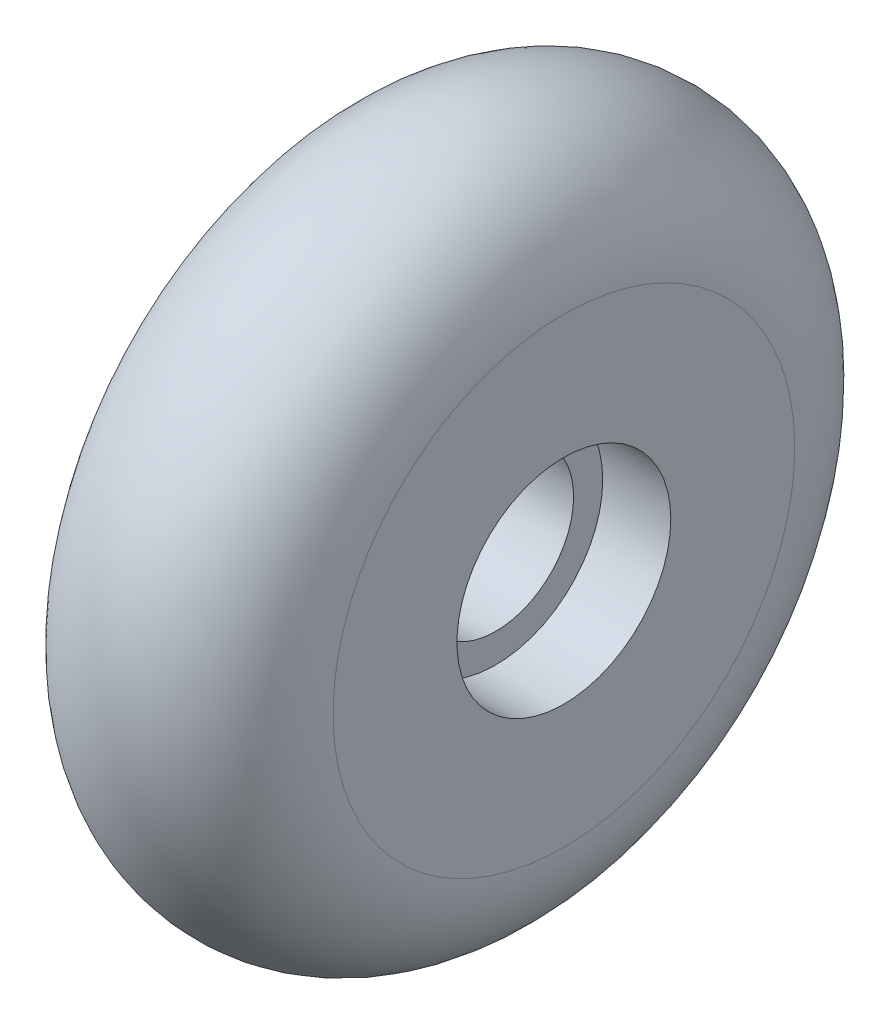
from build123d import *


with BuildPart() as part:
    # Sketch1 → Revolve1 (revolve)
    with BuildSketch(Plane.XY, mode=Mode.PRIVATE) as revolve1_sk:
        with BuildLine():
            Line((0, -12.75), (0, 0))
            ThreePointArc((0, 0), (-12.25, 12.25), (-24.5, 0))
            Line((-24.5, 0), (-24.5, -12.75))
            Line((-24.5, -12.75), (-17.5, -12.75))
            Line((-17.5, -12.75), (-17.5, -15.75))
            Line((-17.5, -15.75), (-7, -15.75))
            Line((-7, -15.75), (-7, -12.75))
            Line((-7, -12.75), (0, -12.75))
        make_face()
    revolve(revolve1_sk.sketch.rotate(Axis((0, -23.75, 0), (-1, 0, 0)), 90), axis=Axis((0, -23.75, 0), (-1, 0, 0)))


solid = part.part
